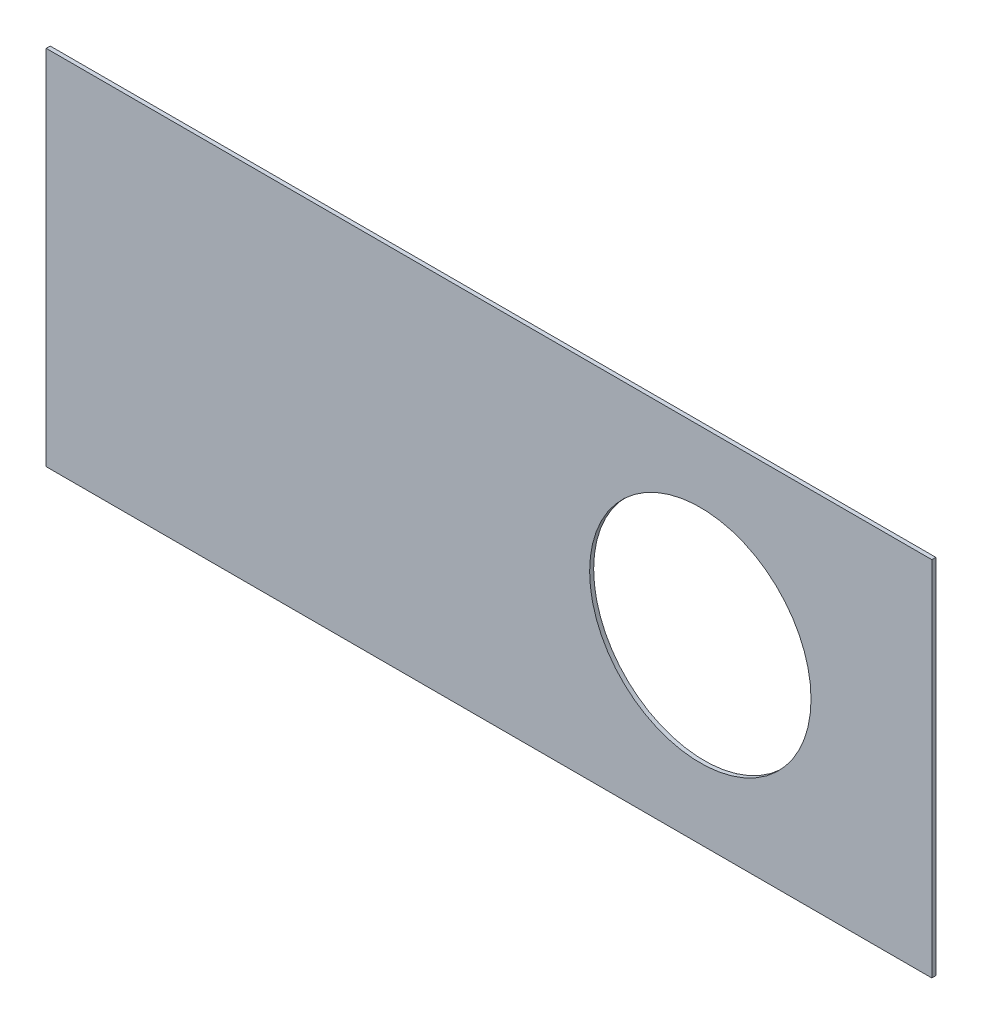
ISO-10303-21;
HEADER;
FILE_DESCRIPTION(('STEP AP214'),'2;1');
FILE_NAME('part.step','',(''),(''),'','','');
FILE_SCHEMA(('AUTOMOTIVE_DESIGN { 1 0 10303 214 1 1 1 1 }'));
ENDSEC;
DATA;
#1=APPLICATION_CONTEXT('core data for automotive mechanical design processes');
#2=APPLICATION_PROTOCOL_DEFINITION('international standard','automotive_design',2000,#1);
#3=PRODUCT_CONTEXT('',#1,'mechanical');
#4=PRODUCT('Part','Part','',(#3));
#5=PRODUCT_RELATED_PRODUCT_CATEGORY('part','',(#4));
#6=PRODUCT_DEFINITION_FORMATION('','',#4);
#7=PRODUCT_DEFINITION_CONTEXT('part definition',#1,'design');
#8=PRODUCT_DEFINITION('design','',#6,#7);
#9=PRODUCT_DEFINITION_SHAPE('','',#8);
#10=(LENGTH_UNIT() NAMED_UNIT(*) SI_UNIT(.MILLI.,.METRE.));
#11=(NAMED_UNIT(*) PLANE_ANGLE_UNIT() SI_UNIT($,.RADIAN.));
#12=(NAMED_UNIT(*) SI_UNIT($,.STERADIAN.) SOLID_ANGLE_UNIT());
#13=UNCERTAINTY_MEASURE_WITH_UNIT(LENGTH_MEASURE(1.E-05),#10,'distance_accuracy_value','');
#14=(GEOMETRIC_REPRESENTATION_CONTEXT(3) GLOBAL_UNCERTAINTY_ASSIGNED_CONTEXT((#13)) GLOBAL_UNIT_ASSIGNED_CONTEXT((#10,
#11,#12)) REPRESENTATION_CONTEXT('',''));
#15=CARTESIAN_POINT('',(0.,0.,0.));
#16=DIRECTION('',(0.,0.,1.));
#17=DIRECTION('',(1.,0.,0.));
#18=AXIS2_PLACEMENT_3D('',#15,#16,#17);
#19=CARTESIAN_POINT('',(0.,0.,1.));
#20=DIRECTION('',(0.,0.,1.));
#21=DIRECTION('',(1.,0.,0.));
#22=AXIS2_PLACEMENT_3D('',#19,#20,#21);
#23=PLANE('',#22);
#24=DIRECTION('',(0.,-1.,0.));
#25=VECTOR('',#24,1.);
#26=CARTESIAN_POINT('',(-151.599354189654,47.8521126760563,1.));
#27=LINE('',#26,#25);
#28=CARTESIAN_POINT('',(-151.599354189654,47.8521126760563,1.));
#29=VERTEX_POINT('',#28);
#30=CARTESIAN_POINT('',(-151.599354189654,-42.1478873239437,1.));
#31=VERTEX_POINT('',#30);
#32=EDGE_CURVE('E94',#29,#31,#27,.T.);
#33=ORIENTED_EDGE('',*,*,#32,.T.);
#34=DIRECTION('',(1.,0.,0.));
#35=VECTOR('',#34,1.);
#36=CARTESIAN_POINT('',(-151.599354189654,-42.1478873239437,1.));
#37=LINE('',#36,#35);
#38=CARTESIAN_POINT('',(68.400645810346,-42.1478873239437,1.));
#39=VERTEX_POINT('',#38);
#40=EDGE_CURVE('E89',#31,#39,#37,.T.);
#41=ORIENTED_EDGE('',*,*,#40,.T.);
#42=DIRECTION('',(0.,1.,0.));
#43=VECTOR('',#42,1.);
#44=CARTESIAN_POINT('',(68.400645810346,47.8521126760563,1.));
#45=LINE('',#44,#43);
#46=CARTESIAN_POINT('',(68.400645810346,47.8521126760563,1.));
#47=VERTEX_POINT('',#46);
#48=EDGE_CURVE('E92',#39,#47,#45,.T.);
#49=ORIENTED_EDGE('',*,*,#48,.T.);
#50=DIRECTION('',(-1.,0.,0.));
#51=VECTOR('',#50,1.);
#52=CARTESIAN_POINT('',(-151.599354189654,47.8521126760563,1.));
#53=LINE('',#52,#51);
#54=EDGE_CURVE('E59',#47,#29,#53,.T.);
#55=ORIENTED_EDGE('',*,*,#54,.T.);
#56=EDGE_LOOP('',(#33,#41,#49,#55));
#57=FACE_BOUND('',#56,.T.);
#58=CARTESIAN_POINT('',(10.900645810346,2.85211267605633,1.));
#59=DIRECTION('',(0.,0.,1.));
#60=DIRECTION('',(1.,0.,0.));
#61=AXIS2_PLACEMENT_3D('',#58,#59,#60);
#62=CIRCLE('',#61,27.5);
#63=CARTESIAN_POINT('',(38.400645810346,2.85211267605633,1.));
#64=VERTEX_POINT('',#63);
#65=EDGE_CURVE('E110',#64,#64,#62,.T.);
#66=ORIENTED_EDGE('',*,*,#65,.F.);
#67=EDGE_LOOP('',(#66));
#68=FACE_BOUND('',#67,.T.);
#69=ADVANCED_FACE('F40',(#57,#68),#23,.T.);
#70=CARTESIAN_POINT('',(0.,0.,0.));
#71=DIRECTION('',(0.,0.,1.));
#72=DIRECTION('',(1.,0.,0.));
#73=AXIS2_PLACEMENT_3D('',#70,#71,#72);
#74=PLANE('',#73);
#75=DIRECTION('',(0.,-1.,0.));
#76=VECTOR('',#75,1.);
#77=CARTESIAN_POINT('',(-151.599354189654,47.8521126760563,0.));
#78=LINE('',#77,#76);
#79=CARTESIAN_POINT('',(-151.599354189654,47.8521126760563,0.));
#80=VERTEX_POINT('',#79);
#81=CARTESIAN_POINT('',(-151.599354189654,-42.1478873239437,0.));
#82=VERTEX_POINT('',#81);
#83=EDGE_CURVE('E107',#80,#82,#78,.T.);
#84=ORIENTED_EDGE('',*,*,#83,.F.);
#85=DIRECTION('',(-1.,0.,0.));
#86=VECTOR('',#85,1.);
#87=CARTESIAN_POINT('',(-151.599354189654,47.8521126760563,0.));
#88=LINE('',#87,#86);
#89=CARTESIAN_POINT('',(68.400645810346,47.8521126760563,0.));
#90=VERTEX_POINT('',#89);
#91=EDGE_CURVE('E82',#90,#80,#88,.T.);
#92=ORIENTED_EDGE('',*,*,#91,.F.);
#93=DIRECTION('',(0.,1.,0.));
#94=VECTOR('',#93,1.);
#95=CARTESIAN_POINT('',(68.400645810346,47.8521126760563,0.));
#96=LINE('',#95,#94);
#97=CARTESIAN_POINT('',(68.400645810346,-42.1478873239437,0.));
#98=VERTEX_POINT('',#97);
#99=EDGE_CURVE('E76',#98,#90,#96,.T.);
#100=ORIENTED_EDGE('',*,*,#99,.F.);
#101=DIRECTION('',(1.,0.,0.));
#102=VECTOR('',#101,1.);
#103=CARTESIAN_POINT('',(-151.599354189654,-42.1478873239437,0.));
#104=LINE('',#103,#102);
#105=EDGE_CURVE('E98',#82,#98,#104,.T.);
#106=ORIENTED_EDGE('',*,*,#105,.F.);
#107=EDGE_LOOP('',(#84,#92,#100,#106));
#108=FACE_BOUND('',#107,.T.);
#109=CARTESIAN_POINT('',(10.900645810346,2.85211267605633,0.));
#110=DIRECTION('',(0.,0.,1.));
#111=DIRECTION('',(1.,0.,0.));
#112=AXIS2_PLACEMENT_3D('',#109,#110,#111);
#113=CIRCLE('',#112,27.5);
#114=CARTESIAN_POINT('',(38.400645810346,2.85211267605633,0.));
#115=VERTEX_POINT('',#114);
#116=EDGE_CURVE('E125',#115,#115,#113,.T.);
#117=ORIENTED_EDGE('',*,*,#116,.T.);
#118=EDGE_LOOP('',(#117));
#119=FACE_BOUND('',#118,.T.);
#120=ADVANCED_FACE('F118',(#108,#119),#74,.F.);
#121=CARTESIAN_POINT('',(-151.599354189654,47.8521126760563,1.));
#122=DIRECTION('',(1.,0.,0.));
#123=DIRECTION('',(0.,0.,-1.));
#124=AXIS2_PLACEMENT_3D('',#121,#122,#123);
#125=PLANE('',#124);
#126=ORIENTED_EDGE('',*,*,#83,.T.);
#127=DIRECTION('',(0.,0.,-1.));
#128=VECTOR('',#127,1.);
#129=CARTESIAN_POINT('',(-151.599354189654,-42.1478873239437,1.));
#130=LINE('',#129,#128);
#131=EDGE_CURVE('E12',#31,#82,#130,.T.);
#132=ORIENTED_EDGE('',*,*,#131,.F.);
#133=ORIENTED_EDGE('',*,*,#32,.F.);
#134=DIRECTION('',(0.,0.,-1.));
#135=VECTOR('',#134,1.);
#136=CARTESIAN_POINT('',(-151.599354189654,47.8521126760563,1.));
#137=LINE('',#136,#135);
#138=EDGE_CURVE('E103',#29,#80,#137,.T.);
#139=ORIENTED_EDGE('',*,*,#138,.T.);
#140=EDGE_LOOP('',(#126,#132,#133,#139));
#141=FACE_BOUND('',#140,.T.);
#142=ADVANCED_FACE('F42',(#141),#125,.F.);
#143=CARTESIAN_POINT('',(-151.599354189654,-42.1478873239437,1.));
#144=DIRECTION('',(0.,1.,0.));
#145=DIRECTION('',(0.,0.,1.));
#146=AXIS2_PLACEMENT_3D('',#143,#144,#145);
#147=PLANE('',#146);
#148=ORIENTED_EDGE('',*,*,#105,.T.);
#149=DIRECTION('',(0.,0.,-1.));
#150=VECTOR('',#149,1.);
#151=CARTESIAN_POINT('',(68.400645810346,-42.1478873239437,1.));
#152=LINE('',#151,#150);
#153=EDGE_CURVE('E49',#39,#98,#152,.T.);
#154=ORIENTED_EDGE('',*,*,#153,.F.);
#155=ORIENTED_EDGE('',*,*,#40,.F.);
#156=ORIENTED_EDGE('',*,*,#131,.T.);
#157=EDGE_LOOP('',(#148,#154,#155,#156));
#158=FACE_BOUND('',#157,.T.);
#159=ADVANCED_FACE('F97',(#158),#147,.F.);
#160=CARTESIAN_POINT('',(68.400645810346,47.8521126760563,1.));
#161=DIRECTION('',(-1.,0.,0.));
#162=DIRECTION('',(0.,0.,1.));
#163=AXIS2_PLACEMENT_3D('',#160,#161,#162);
#164=PLANE('',#163);
#165=ORIENTED_EDGE('',*,*,#99,.T.);
#166=DIRECTION('',(0.,0.,-1.));
#167=VECTOR('',#166,1.);
#168=CARTESIAN_POINT('',(68.400645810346,47.8521126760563,1.));
#169=LINE('',#168,#167);
#170=EDGE_CURVE('E99',#47,#90,#169,.T.);
#171=ORIENTED_EDGE('',*,*,#170,.F.);
#172=ORIENTED_EDGE('',*,*,#48,.F.);
#173=ORIENTED_EDGE('',*,*,#153,.T.);
#174=EDGE_LOOP('',(#165,#171,#172,#173));
#175=FACE_BOUND('',#174,.T.);
#176=ADVANCED_FACE('F100',(#175),#164,.F.);
#177=CARTESIAN_POINT('',(-151.599354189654,47.8521126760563,1.));
#178=DIRECTION('',(0.,-1.,0.));
#179=DIRECTION('',(0.,0.,-1.));
#180=AXIS2_PLACEMENT_3D('',#177,#178,#179);
#181=PLANE('',#180);
#182=ORIENTED_EDGE('',*,*,#91,.T.);
#183=ORIENTED_EDGE('',*,*,#138,.F.);
#184=ORIENTED_EDGE('',*,*,#54,.F.);
#185=ORIENTED_EDGE('',*,*,#170,.T.);
#186=EDGE_LOOP('',(#182,#183,#184,#185));
#187=FACE_BOUND('',#186,.T.);
#188=ADVANCED_FACE('F115',(#187),#181,.F.);
#189=CARTESIAN_POINT('',(10.900645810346,2.85211267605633,1.));
#190=DIRECTION('',(0.,0.,-1.));
#191=DIRECTION('',(-1.,0.,0.));
#192=AXIS2_PLACEMENT_3D('',#189,#190,#191);
#193=CYLINDRICAL_SURFACE('',#192,27.5);
#194=ORIENTED_EDGE('',*,*,#65,.T.);
#195=EDGE_LOOP('',(#194));
#196=FACE_BOUND('',#195,.T.);
#197=ORIENTED_EDGE('',*,*,#116,.F.);
#198=EDGE_LOOP('',(#197));
#199=FACE_BOUND('',#198,.T.);
#200=ADVANCED_FACE('F131',(#196,#199),#193,.F.);
#201=CLOSED_SHELL('',(#69,#120,#142,#159,#176,#188,#200));
#202=MANIFOLD_SOLID_BREP('B2',#201);
#203=ADVANCED_BREP_SHAPE_REPRESENTATION('',(#18,#202),#14);
#204=SHAPE_DEFINITION_REPRESENTATION(#9,#203);
ENDSEC;
END-ISO-10303-21;
